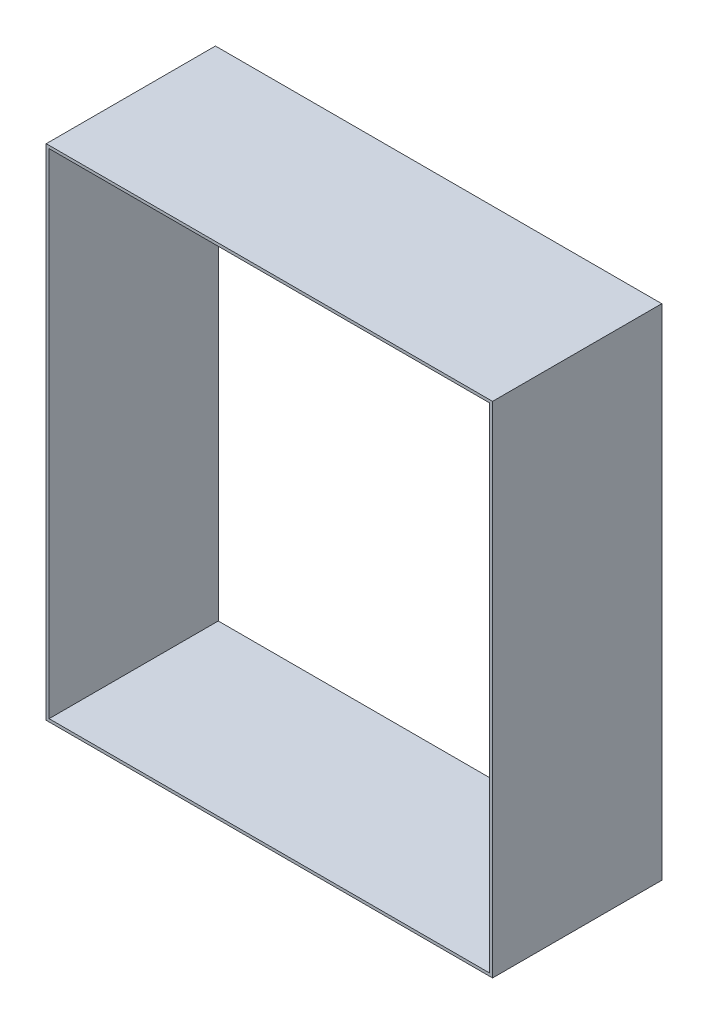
ISO-10303-21;
HEADER;
FILE_DESCRIPTION(('STEP AP214'),'2;1');
FILE_NAME('part.step','',(''),(''),'','','');
FILE_SCHEMA(('AUTOMOTIVE_DESIGN { 1 0 10303 214 1 1 1 1 }'));
ENDSEC;
DATA;
#1=APPLICATION_CONTEXT('core data for automotive mechanical design processes');
#2=APPLICATION_PROTOCOL_DEFINITION('international standard','automotive_design',2000,#1);
#3=PRODUCT_CONTEXT('',#1,'mechanical');
#4=PRODUCT('Part','Part','',(#3));
#5=PRODUCT_RELATED_PRODUCT_CATEGORY('part','',(#4));
#6=PRODUCT_DEFINITION_FORMATION('','',#4);
#7=PRODUCT_DEFINITION_CONTEXT('part definition',#1,'design');
#8=PRODUCT_DEFINITION('design','',#6,#7);
#9=PRODUCT_DEFINITION_SHAPE('','',#8);
#10=(LENGTH_UNIT() NAMED_UNIT(*) SI_UNIT(.MILLI.,.METRE.));
#11=(NAMED_UNIT(*) PLANE_ANGLE_UNIT() SI_UNIT($,.RADIAN.));
#12=(NAMED_UNIT(*) SI_UNIT($,.STERADIAN.) SOLID_ANGLE_UNIT());
#13=UNCERTAINTY_MEASURE_WITH_UNIT(LENGTH_MEASURE(1.E-05),#10,'distance_accuracy_value','');
#14=(GEOMETRIC_REPRESENTATION_CONTEXT(3) GLOBAL_UNCERTAINTY_ASSIGNED_CONTEXT((#13)) GLOBAL_UNIT_ASSIGNED_CONTEXT((#10,
#11,#12)) REPRESENTATION_CONTEXT('',''));
#15=CARTESIAN_POINT('',(0.,0.,0.));
#16=DIRECTION('',(0.,0.,1.));
#17=DIRECTION('',(1.,0.,0.));
#18=AXIS2_PLACEMENT_3D('',#15,#16,#17);
#19=CARTESIAN_POINT('',(24.74,0.,-9.5));
#20=DIRECTION('',(1.,0.,0.));
#21=DIRECTION('',(0.,1.,0.));
#22=AXIS2_PLACEMENT_3D('',#19,#20,#21);
#23=PLANE('',#22);
#24=DIRECTION('',(0.,0.,1.));
#25=VECTOR('',#24,1.);
#26=CARTESIAN_POINT('',(24.74,0.,-9.5));
#27=LINE('',#26,#25);
#28=CARTESIAN_POINT('',(24.74,0.,0.));
#29=VERTEX_POINT('',#28);
#30=CARTESIAN_POINT('',(24.74,0.,-9.5));
#31=VERTEX_POINT('',#30);
#32=EDGE_CURVE('E94',#29,#31,#27,.F.);
#33=ORIENTED_EDGE('',*,*,#32,.T.);
#34=DIRECTION('',(0.,1.,0.));
#35=VECTOR('',#34,1.);
#36=CARTESIAN_POINT('',(24.74,0.,-9.5));
#37=LINE('',#36,#35);
#38=CARTESIAN_POINT('',(24.74,-27.72,-9.5));
#39=VERTEX_POINT('',#38);
#40=EDGE_CURVE('E112',#31,#39,#37,.F.);
#41=ORIENTED_EDGE('',*,*,#40,.T.);
#42=DIRECTION('',(0.,0.,-1.));
#43=VECTOR('',#42,1.);
#44=CARTESIAN_POINT('',(24.74,-27.72,-9.5));
#45=LINE('',#44,#43);
#46=CARTESIAN_POINT('',(24.74,-27.72,0.));
#47=VERTEX_POINT('',#46);
#48=EDGE_CURVE('E19',#39,#47,#45,.F.);
#49=ORIENTED_EDGE('',*,*,#48,.T.);
#50=DIRECTION('',(0.,1.,0.));
#51=VECTOR('',#50,1.);
#52=CARTESIAN_POINT('',(24.74,0.,0.));
#53=LINE('',#52,#51);
#54=EDGE_CURVE('E102',#29,#47,#53,.F.);
#55=ORIENTED_EDGE('',*,*,#54,.F.);
#56=EDGE_LOOP('',(#33,#41,#49,#55));
#57=FACE_BOUND('',#56,.T.);
#58=ADVANCED_FACE('F16',(#57),#23,.F.);
#59=CARTESIAN_POINT('',(0.,-27.72,-9.5));
#60=DIRECTION('',(0.,-1.,0.));
#61=DIRECTION('',(0.,0.,-1.));
#62=AXIS2_PLACEMENT_3D('',#59,#60,#61);
#63=PLANE('',#62);
#64=ORIENTED_EDGE('',*,*,#48,.F.);
#65=DIRECTION('',(1.,0.,0.));
#66=VECTOR('',#65,1.);
#67=CARTESIAN_POINT('',(0.,-27.72,-9.5));
#68=LINE('',#67,#66);
#69=CARTESIAN_POINT('',(0.,-27.72,-9.5));
#70=VERTEX_POINT('',#69);
#71=EDGE_CURVE('E126',#39,#70,#68,.F.);
#72=ORIENTED_EDGE('',*,*,#71,.T.);
#73=DIRECTION('',(0.,0.,1.));
#74=VECTOR('',#73,1.);
#75=CARTESIAN_POINT('',(0.,-27.72,-9.5));
#76=LINE('',#75,#74);
#77=CARTESIAN_POINT('',(0.,-27.72,0.));
#78=VERTEX_POINT('',#77);
#79=EDGE_CURVE('E78',#70,#78,#76,.T.);
#80=ORIENTED_EDGE('',*,*,#79,.T.);
#81=DIRECTION('',(1.,0.,0.));
#82=VECTOR('',#81,1.);
#83=CARTESIAN_POINT('',(0.,-27.72,0.));
#84=LINE('',#83,#82);
#85=EDGE_CURVE('E105',#47,#78,#84,.F.);
#86=ORIENTED_EDGE('',*,*,#85,.F.);
#87=EDGE_LOOP('',(#64,#72,#80,#86));
#88=FACE_BOUND('',#87,.T.);
#89=ADVANCED_FACE('F114',(#88),#63,.F.);
#90=CARTESIAN_POINT('',(0.,0.,-9.5));
#91=DIRECTION('',(-1.,0.,0.));
#92=DIRECTION('',(0.,-1.,0.));
#93=AXIS2_PLACEMENT_3D('',#90,#91,#92);
#94=PLANE('',#93);
#95=ORIENTED_EDGE('',*,*,#79,.F.);
#96=DIRECTION('',(0.,1.,0.));
#97=VECTOR('',#96,1.);
#98=CARTESIAN_POINT('',(0.,0.,-9.5));
#99=LINE('',#98,#97);
#100=CARTESIAN_POINT('',(0.,0.,-9.5));
#101=VERTEX_POINT('',#100);
#102=EDGE_CURVE('E90',#70,#101,#99,.T.);
#103=ORIENTED_EDGE('',*,*,#102,.T.);
#104=DIRECTION('',(0.,0.,1.));
#105=VECTOR('',#104,1.);
#106=CARTESIAN_POINT('',(0.,0.,-9.5));
#107=LINE('',#106,#105);
#108=CARTESIAN_POINT('',(0.,0.,0.));
#109=VERTEX_POINT('',#108);
#110=EDGE_CURVE('E83',#101,#109,#107,.T.);
#111=ORIENTED_EDGE('',*,*,#110,.T.);
#112=DIRECTION('',(0.,1.,0.));
#113=VECTOR('',#112,1.);
#114=CARTESIAN_POINT('',(0.,0.,0.));
#115=LINE('',#114,#113);
#116=EDGE_CURVE('E87',#78,#109,#115,.T.);
#117=ORIENTED_EDGE('',*,*,#116,.F.);
#118=EDGE_LOOP('',(#95,#103,#111,#117));
#119=FACE_BOUND('',#118,.T.);
#120=ADVANCED_FACE('F85',(#119),#94,.F.);
#121=CARTESIAN_POINT('',(0.,0.,-9.5));
#122=DIRECTION('',(0.,1.,0.));
#123=DIRECTION('',(0.,0.,1.));
#124=AXIS2_PLACEMENT_3D('',#121,#122,#123);
#125=PLANE('',#124);
#126=ORIENTED_EDGE('',*,*,#110,.F.);
#127=DIRECTION('',(1.,0.,0.));
#128=VECTOR('',#127,1.);
#129=CARTESIAN_POINT('',(0.,0.,-9.5));
#130=LINE('',#129,#128);
#131=EDGE_CURVE('E129',#101,#31,#130,.T.);
#132=ORIENTED_EDGE('',*,*,#131,.T.);
#133=ORIENTED_EDGE('',*,*,#32,.F.);
#134=DIRECTION('',(1.,0.,0.));
#135=VECTOR('',#134,1.);
#136=CARTESIAN_POINT('',(0.,0.,0.));
#137=LINE('',#136,#135);
#138=EDGE_CURVE('E97',#109,#29,#137,.T.);
#139=ORIENTED_EDGE('',*,*,#138,.F.);
#140=EDGE_LOOP('',(#126,#132,#133,#139));
#141=FACE_BOUND('',#140,.T.);
#142=ADVANCED_FACE('F98',(#141),#125,.F.);
#143=CARTESIAN_POINT('',(24.9,0.16,-9.5));
#144=DIRECTION('',(1.,0.,0.));
#145=DIRECTION('',(0.,1.,0.));
#146=AXIS2_PLACEMENT_3D('',#143,#144,#145);
#147=PLANE('',#146);
#148=DIRECTION('',(0.,1.,0.));
#149=VECTOR('',#148,1.);
#150=CARTESIAN_POINT('',(24.9,0.,-9.5));
#151=LINE('',#150,#149);
#152=CARTESIAN_POINT('',(24.9,-27.88,-9.5));
#153=VERTEX_POINT('',#152);
#154=CARTESIAN_POINT('',(24.9,0.16,-9.5));
#155=VERTEX_POINT('',#154);
#156=EDGE_CURVE('E131',#153,#155,#151,.T.);
#157=ORIENTED_EDGE('',*,*,#156,.T.);
#158=DIRECTION('',(0.,0.,1.));
#159=VECTOR('',#158,1.);
#160=CARTESIAN_POINT('',(24.9,0.16,-9.5));
#161=LINE('',#160,#159);
#162=CARTESIAN_POINT('',(24.9,0.16,0.));
#163=VERTEX_POINT('',#162);
#164=EDGE_CURVE('E122',#163,#155,#161,.F.);
#165=ORIENTED_EDGE('',*,*,#164,.F.);
#166=DIRECTION('',(0.,1.,0.));
#167=VECTOR('',#166,1.);
#168=CARTESIAN_POINT('',(24.9,0.,0.));
#169=LINE('',#168,#167);
#170=CARTESIAN_POINT('',(24.9,-27.88,0.));
#171=VERTEX_POINT('',#170);
#172=EDGE_CURVE('E115',#171,#163,#169,.T.);
#173=ORIENTED_EDGE('',*,*,#172,.F.);
#174=DIRECTION('',(0.,0.,-1.));
#175=VECTOR('',#174,1.);
#176=CARTESIAN_POINT('',(24.9,-27.88,-9.5));
#177=LINE('',#176,#175);
#178=EDGE_CURVE('E139',#153,#171,#177,.F.);
#179=ORIENTED_EDGE('',*,*,#178,.F.);
#180=EDGE_LOOP('',(#157,#165,#173,#179));
#181=FACE_BOUND('',#180,.T.);
#182=ADVANCED_FACE('F160',(#181),#147,.T.);
#183=CARTESIAN_POINT('',(0.,0.,0.));
#184=DIRECTION('',(0.,0.,1.));
#185=DIRECTION('',(1.,0.,0.));
#186=AXIS2_PLACEMENT_3D('',#183,#184,#185);
#187=PLANE('',#186);
#188=ORIENTED_EDGE('',*,*,#172,.T.);
#189=DIRECTION('',(1.,0.,0.));
#190=VECTOR('',#189,1.);
#191=CARTESIAN_POINT('',(-0.16,0.16,0.));
#192=LINE('',#191,#190);
#193=CARTESIAN_POINT('',(-0.16,0.16,0.));
#194=VERTEX_POINT('',#193);
#195=EDGE_CURVE('E119',#194,#163,#192,.T.);
#196=ORIENTED_EDGE('',*,*,#195,.F.);
#197=DIRECTION('',(0.,-1.,0.));
#198=VECTOR('',#197,1.);
#199=CARTESIAN_POINT('',(-0.16,0.16,0.));
#200=LINE('',#199,#198);
#201=CARTESIAN_POINT('',(-0.159999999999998,-27.88,0.));
#202=VERTEX_POINT('',#201);
#203=EDGE_CURVE('E142',#202,#194,#200,.F.);
#204=ORIENTED_EDGE('',*,*,#203,.F.);
#205=DIRECTION('',(1.,0.,0.));
#206=VECTOR('',#205,1.);
#207=CARTESIAN_POINT('',(-0.159999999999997,-27.88,0.));
#208=LINE('',#207,#206);
#209=EDGE_CURVE('E135',#171,#202,#208,.F.);
#210=ORIENTED_EDGE('',*,*,#209,.F.);
#211=EDGE_LOOP('',(#188,#196,#204,#210));
#212=FACE_BOUND('',#211,.T.);
#213=ORIENTED_EDGE('',*,*,#54,.T.);
#214=ORIENTED_EDGE('',*,*,#85,.T.);
#215=ORIENTED_EDGE('',*,*,#116,.T.);
#216=ORIENTED_EDGE('',*,*,#138,.T.);
#217=EDGE_LOOP('',(#213,#214,#215,#216));
#218=FACE_BOUND('',#217,.T.);
#219=ADVANCED_FACE('F104',(#212,#218),#187,.T.);
#220=CARTESIAN_POINT('',(-0.16,0.16,-9.5));
#221=DIRECTION('',(0.,1.,0.));
#222=DIRECTION('',(0.,0.,1.));
#223=AXIS2_PLACEMENT_3D('',#220,#221,#222);
#224=PLANE('',#223);
#225=DIRECTION('',(1.,0.,0.));
#226=VECTOR('',#225,1.);
#227=CARTESIAN_POINT('',(0.,0.16,-9.5));
#228=LINE('',#227,#226);
#229=CARTESIAN_POINT('',(-0.16,0.16,-9.5));
#230=VERTEX_POINT('',#229);
#231=EDGE_CURVE('E133',#155,#230,#228,.F.);
#232=ORIENTED_EDGE('',*,*,#231,.T.);
#233=DIRECTION('',(0.,0.,1.));
#234=VECTOR('',#233,1.);
#235=CARTESIAN_POINT('',(-0.16,0.16,-9.5));
#236=LINE('',#235,#234);
#237=EDGE_CURVE('E145',#194,#230,#236,.F.);
#238=ORIENTED_EDGE('',*,*,#237,.F.);
#239=ORIENTED_EDGE('',*,*,#195,.T.);
#240=ORIENTED_EDGE('',*,*,#164,.T.);
#241=EDGE_LOOP('',(#232,#238,#239,#240));
#242=FACE_BOUND('',#241,.T.);
#243=ADVANCED_FACE('F157',(#242),#224,.T.);
#244=CARTESIAN_POINT('',(0.,0.,-9.5));
#245=DIRECTION('',(0.,0.,1.));
#246=DIRECTION('',(1.,0.,0.));
#247=AXIS2_PLACEMENT_3D('',#244,#245,#246);
#248=PLANE('',#247);
#249=ORIENTED_EDGE('',*,*,#231,.F.);
#250=ORIENTED_EDGE('',*,*,#156,.F.);
#251=DIRECTION('',(1.,0.,0.));
#252=VECTOR('',#251,1.);
#253=CARTESIAN_POINT('',(-0.159999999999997,-27.88,-9.5));
#254=LINE('',#253,#252);
#255=CARTESIAN_POINT('',(-0.159999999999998,-27.88,-9.5));
#256=VERTEX_POINT('',#255);
#257=EDGE_CURVE('E34',#256,#153,#254,.T.);
#258=ORIENTED_EDGE('',*,*,#257,.F.);
#259=DIRECTION('',(0.,-1.,0.));
#260=VECTOR('',#259,1.);
#261=CARTESIAN_POINT('',(-0.16,0.16,-9.5));
#262=LINE('',#261,#260);
#263=EDGE_CURVE('E25',#230,#256,#262,.T.);
#264=ORIENTED_EDGE('',*,*,#263,.F.);
#265=EDGE_LOOP('',(#249,#250,#258,#264));
#266=FACE_BOUND('',#265,.T.);
#267=ORIENTED_EDGE('',*,*,#102,.F.);
#268=ORIENTED_EDGE('',*,*,#71,.F.);
#269=ORIENTED_EDGE('',*,*,#40,.F.);
#270=ORIENTED_EDGE('',*,*,#131,.F.);
#271=EDGE_LOOP('',(#267,#268,#269,#270));
#272=FACE_BOUND('',#271,.T.);
#273=ADVANCED_FACE('F153',(#266,#272),#248,.F.);
#274=CARTESIAN_POINT('',(-0.159999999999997,-27.88,-9.5));
#275=DIRECTION('',(0.,-1.,0.));
#276=DIRECTION('',(0.,0.,-1.));
#277=AXIS2_PLACEMENT_3D('',#274,#275,#276);
#278=PLANE('',#277);
#279=ORIENTED_EDGE('',*,*,#257,.T.);
#280=ORIENTED_EDGE('',*,*,#178,.T.);
#281=ORIENTED_EDGE('',*,*,#209,.T.);
#282=DIRECTION('',(0.,0.,1.));
#283=VECTOR('',#282,1.);
#284=CARTESIAN_POINT('',(-0.159999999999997,-27.88,-9.5));
#285=LINE('',#284,#283);
#286=EDGE_CURVE('E11',#256,#202,#285,.T.);
#287=ORIENTED_EDGE('',*,*,#286,.F.);
#288=EDGE_LOOP('',(#279,#280,#281,#287));
#289=FACE_BOUND('',#288,.T.);
#290=ADVANCED_FACE('F163',(#289),#278,.T.);
#291=CARTESIAN_POINT('',(-0.16,0.16,-9.5));
#292=DIRECTION('',(-1.,0.,0.));
#293=DIRECTION('',(0.,-1.,0.));
#294=AXIS2_PLACEMENT_3D('',#291,#292,#293);
#295=PLANE('',#294);
#296=ORIENTED_EDGE('',*,*,#263,.T.);
#297=ORIENTED_EDGE('',*,*,#286,.T.);
#298=ORIENTED_EDGE('',*,*,#203,.T.);
#299=ORIENTED_EDGE('',*,*,#237,.T.);
#300=EDGE_LOOP('',(#296,#297,#298,#299));
#301=FACE_BOUND('',#300,.T.);
#302=ADVANCED_FACE('F150',(#301),#295,.T.);
#303=CLOSED_SHELL('',(#58,#89,#120,#142,#182,#219,#243,#273,#290,#302));
#304=MANIFOLD_SOLID_BREP('B1',#303);
#305=ADVANCED_BREP_SHAPE_REPRESENTATION('',(#18,#304),#14);
#306=SHAPE_DEFINITION_REPRESENTATION(#9,#305);
ENDSEC;
END-ISO-10303-21;
